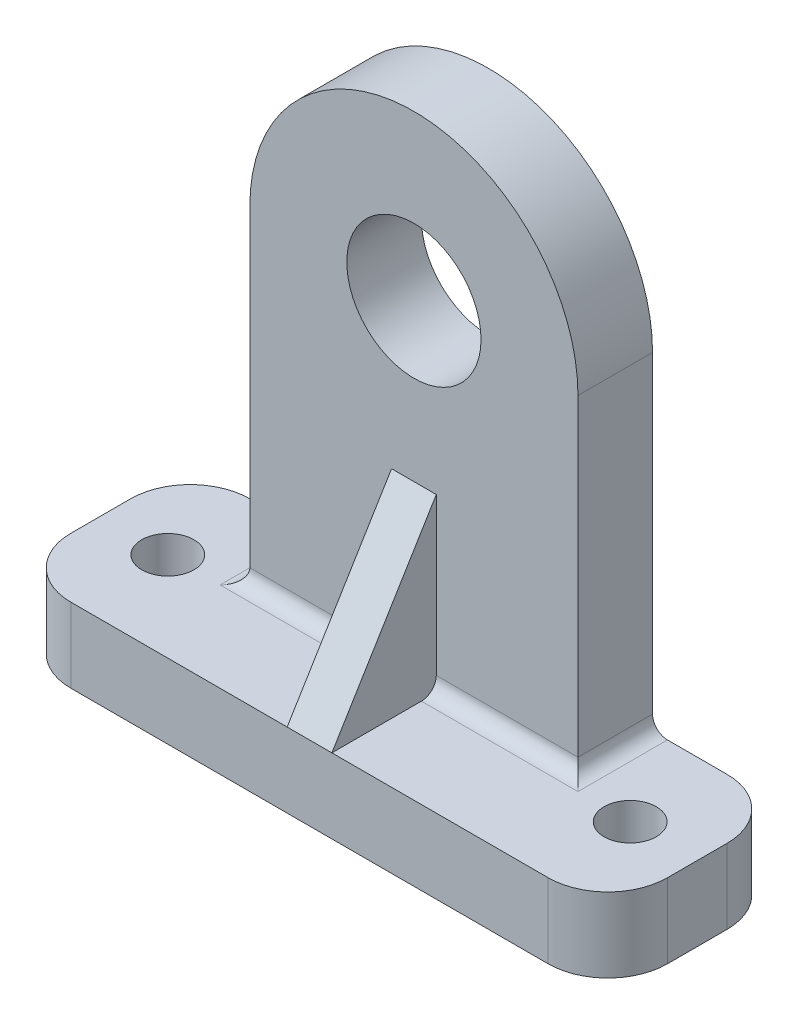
ISO-10303-21;
HEADER;
FILE_DESCRIPTION(('STEP AP214'),'2;1');
FILE_NAME('part.step','',(''),(''),'','','');
FILE_SCHEMA(('AUTOMOTIVE_DESIGN { 1 0 10303 214 1 1 1 1 }'));
ENDSEC;
DATA;
#1=APPLICATION_CONTEXT('core data for automotive mechanical design processes');
#2=APPLICATION_PROTOCOL_DEFINITION('international standard','automotive_design',2000,#1);
#3=PRODUCT_CONTEXT('',#1,'mechanical');
#4=PRODUCT('Part','Part','',(#3));
#5=PRODUCT_RELATED_PRODUCT_CATEGORY('part','',(#4));
#6=PRODUCT_DEFINITION_FORMATION('','',#4);
#7=PRODUCT_DEFINITION_CONTEXT('part definition',#1,'design');
#8=PRODUCT_DEFINITION('design','',#6,#7);
#9=PRODUCT_DEFINITION_SHAPE('','',#8);
#10=(LENGTH_UNIT() NAMED_UNIT(*) SI_UNIT(.MILLI.,.METRE.));
#11=(NAMED_UNIT(*) PLANE_ANGLE_UNIT() SI_UNIT($,.RADIAN.));
#12=(NAMED_UNIT(*) SI_UNIT($,.STERADIAN.) SOLID_ANGLE_UNIT());
#13=UNCERTAINTY_MEASURE_WITH_UNIT(LENGTH_MEASURE(1.E-05),#10,'distance_accuracy_value','');
#14=(GEOMETRIC_REPRESENTATION_CONTEXT(3) GLOBAL_UNCERTAINTY_ASSIGNED_CONTEXT((#13)) GLOBAL_UNIT_ASSIGNED_CONTEXT((#10,
#11,#12)) REPRESENTATION_CONTEXT('',''));
#15=CARTESIAN_POINT('',(0.,0.,0.));
#16=DIRECTION('',(0.,0.,1.));
#17=DIRECTION('',(1.,0.,0.));
#18=AXIS2_PLACEMENT_3D('',#15,#16,#17);
#19=CARTESIAN_POINT('',(0.,-22.,0.));
#20=DIRECTION('',(0.,1.,0.));
#21=DIRECTION('',(0.,0.,1.));
#22=AXIS2_PLACEMENT_3D('',#19,#20,#21);
#23=PLANE('',#22);
#24=CARTESIAN_POINT('',(-15.5,-22.,6.));
#25=DIRECTION('',(0.,-1.,0.));
#26=DIRECTION('',(0.,0.,1.));
#27=AXIS2_PLACEMENT_3D('',#24,#25,#26);
#28=CIRCLE('',#27,1.75);
#29=CARTESIAN_POINT('',(-15.5,-22.,7.75));
#30=VERTEX_POINT('',#29);
#31=EDGE_CURVE('E293',#30,#30,#28,.T.);
#32=ORIENTED_EDGE('',*,*,#31,.T.);
#33=EDGE_LOOP('',(#32));
#34=FACE_BOUND('',#33,.T.);
#35=DIRECTION('',(-1.,0.,0.));
#36=VECTOR('',#35,1.);
#37=CARTESIAN_POINT('',(-20.,-22.,12.));
#38=LINE('',#37,#36);
#39=CARTESIAN_POINT('',(-1.5,-22.,12.));
#40=VERTEX_POINT('',#39);
#41=CARTESIAN_POINT('',(-16.,-22.,12.));
#42=VERTEX_POINT('',#41);
#43=EDGE_CURVE('E176',#40,#42,#38,.T.);
#44=ORIENTED_EDGE('',*,*,#43,.F.);
#45=DIRECTION('',(0.,0.,-1.));
#46=VECTOR('',#45,1.);
#47=CARTESIAN_POINT('',(-1.5,-22.,0.));
#48=LINE('',#47,#46);
#49=CARTESIAN_POINT('',(-1.5,-22.,6.));
#50=VERTEX_POINT('',#49);
#51=EDGE_CURVE('E174',#40,#50,#48,.T.);
#52=ORIENTED_EDGE('',*,*,#51,.T.);
#53=DIRECTION('',(1.,0.,0.));
#54=VECTOR('',#53,1.);
#55=CARTESIAN_POINT('',(-11.,-22.,6.));
#56=LINE('',#55,#54);
#57=CARTESIAN_POINT('',(-12.,-22.,6.));
#58=VERTEX_POINT('',#57);
#59=EDGE_CURVE('E160',#50,#58,#56,.F.);
#60=ORIENTED_EDGE('',*,*,#59,.T.);
#61=DIRECTION('',(0.,0.,-1.));
#62=VECTOR('',#61,1.);
#63=CARTESIAN_POINT('',(-12.,-22.,0.));
#64=LINE('',#63,#62);
#65=CARTESIAN_POINT('',(-12.,-22.,0.));
#66=VERTEX_POINT('',#65);
#67=EDGE_CURVE('E239',#58,#66,#64,.T.);
#68=ORIENTED_EDGE('',*,*,#67,.T.);
#69=DIRECTION('',(1.,0.,0.));
#70=VECTOR('',#69,1.);
#71=CARTESIAN_POINT('',(-20.,-22.,0.));
#72=LINE('',#71,#70);
#73=CARTESIAN_POINT('',(-16.,-22.,0.));
#74=VERTEX_POINT('',#73);
#75=EDGE_CURVE('E265',#74,#66,#72,.T.);
#76=ORIENTED_EDGE('',*,*,#75,.F.);
#77=CARTESIAN_POINT('',(-16.,-22.,4.));
#78=DIRECTION('',(0.,1.,0.));
#79=DIRECTION('',(0.,0.,1.));
#80=AXIS2_PLACEMENT_3D('',#77,#78,#79);
#81=CIRCLE('',#80,4.);
#82=CARTESIAN_POINT('',(-20.,-22.,4.));
#83=VERTEX_POINT('',#82);
#84=EDGE_CURVE('E209',#74,#83,#81,.T.);
#85=ORIENTED_EDGE('',*,*,#84,.T.);
#86=DIRECTION('',(0.,0.,-1.));
#87=VECTOR('',#86,1.);
#88=CARTESIAN_POINT('',(-20.,-22.,0.));
#89=LINE('',#88,#87);
#90=CARTESIAN_POINT('',(-20.,-22.,8.));
#91=VERTEX_POINT('',#90);
#92=EDGE_CURVE('E269',#91,#83,#89,.T.);
#93=ORIENTED_EDGE('',*,*,#92,.F.);
#94=CARTESIAN_POINT('',(-16.,-22.,8.));
#95=DIRECTION('',(0.,1.,0.));
#96=DIRECTION('',(0.,0.,1.));
#97=AXIS2_PLACEMENT_3D('',#94,#95,#96);
#98=CIRCLE('',#97,4.);
#99=EDGE_CURVE('E211',#91,#42,#98,.T.);
#100=ORIENTED_EDGE('',*,*,#99,.T.);
#101=EDGE_LOOP('',(#44,#52,#60,#68,#76,#85,#93,#100));
#102=FACE_BOUND('',#101,.T.);
#103=ADVANCED_FACE('F38',(#34,#102),#23,.T.);
#104=CARTESIAN_POINT('',(0.,-21.,6.));
#105=DIRECTION('',(-1.,0.,0.));
#106=DIRECTION('',(0.,0.,1.));
#107=AXIS2_PLACEMENT_3D('',#104,#105,#106);
#108=CYLINDRICAL_SURFACE('',#107,1.);
#109=CARTESIAN_POINT('',(-1.5,-21.,6.));
#110=DIRECTION('',(1.,0.,0.));
#111=DIRECTION('',(0.,0.,-1.));
#112=AXIS2_PLACEMENT_3D('',#109,#110,#111);
#113=CIRCLE('',#112,1.);
#114=CARTESIAN_POINT('',(-1.5,-21.,5.));
#115=VERTEX_POINT('',#114);
#116=EDGE_CURVE('E46',#115,#50,#113,.F.);
#117=ORIENTED_EDGE('',*,*,#116,.F.);
#118=DIRECTION('',(1.,0.,0.));
#119=VECTOR('',#118,1.);
#120=CARTESIAN_POINT('',(11.,-21.,5.));
#121=LINE('',#120,#119);
#122=CARTESIAN_POINT('',(-11.,-21.,5.));
#123=VERTEX_POINT('',#122);
#124=EDGE_CURVE('E234',#123,#115,#121,.T.);
#125=ORIENTED_EDGE('',*,*,#124,.F.);
#126=CARTESIAN_POINT('',(-12.,-21.,6.));
#127=DIRECTION('',(-0.707106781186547,0.,-0.707106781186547));
#128=DIRECTION('',(-0.707106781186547,0.,0.707106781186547));
#129=AXIS2_PLACEMENT_3D('',#126,#127,#128);
#130=ELLIPSE('',#129,1.41421356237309,1.);
#131=EDGE_CURVE('E166',#58,#123,#130,.F.);
#132=ORIENTED_EDGE('',*,*,#131,.F.);
#133=ORIENTED_EDGE('',*,*,#59,.F.);
#134=EDGE_LOOP('',(#117,#125,#132,#133));
#135=FACE_BOUND('',#134,.T.);
#136=ADVANCED_FACE('F162',(#135),#108,.F.);
#137=CARTESIAN_POINT('',(11.,0.,5.));
#138=DIRECTION('',(1.,0.,0.));
#139=DIRECTION('',(0.,0.,-1.));
#140=AXIS2_PLACEMENT_3D('',#137,#138,#139);
#141=PLANE('',#140);
#142=DIRECTION('',(0.,-1.,0.));
#143=VECTOR('',#142,1.);
#144=CARTESIAN_POINT('',(11.,0.,5.));
#145=LINE('',#144,#143);
#146=CARTESIAN_POINT('',(11.,0.,5.));
#147=VERTEX_POINT('',#146);
#148=CARTESIAN_POINT('',(11.,-21.,5.));
#149=VERTEX_POINT('',#148);
#150=EDGE_CURVE('E251',#147,#149,#145,.T.);
#151=ORIENTED_EDGE('',*,*,#150,.T.);
#152=DIRECTION('',(0.,0.,-1.));
#153=VECTOR('',#152,1.);
#154=CARTESIAN_POINT('',(11.,-21.,0.));
#155=LINE('',#154,#153);
#156=CARTESIAN_POINT('',(11.,-21.,0.));
#157=VERTEX_POINT('',#156);
#158=EDGE_CURVE('E232',#149,#157,#155,.T.);
#159=ORIENTED_EDGE('',*,*,#158,.T.);
#160=DIRECTION('',(0.,-1.,0.));
#161=VECTOR('',#160,1.);
#162=CARTESIAN_POINT('',(11.,0.,0.));
#163=LINE('',#162,#161);
#164=CARTESIAN_POINT('',(11.,0.,0.));
#165=VERTEX_POINT('',#164);
#166=EDGE_CURVE('E255',#165,#157,#163,.T.);
#167=ORIENTED_EDGE('',*,*,#166,.F.);
#168=DIRECTION('',(0.,0.,-1.));
#169=VECTOR('',#168,1.);
#170=CARTESIAN_POINT('',(11.,0.,5.));
#171=LINE('',#170,#169);
#172=EDGE_CURVE('E243',#147,#165,#171,.T.);
#173=ORIENTED_EDGE('',*,*,#172,.F.);
#174=EDGE_LOOP('',(#151,#159,#167,#173));
#175=FACE_BOUND('',#174,.T.);
#176=ADVANCED_FACE('F343',(#175),#141,.T.);
#177=CARTESIAN_POINT('',(0.,0.,5.));
#178=DIRECTION('',(0.,0.,-1.));
#179=DIRECTION('',(-1.,0.,0.));
#180=AXIS2_PLACEMENT_3D('',#177,#178,#179);
#181=CYLINDRICAL_SURFACE('',#180,11.);
#182=CARTESIAN_POINT('',(0.,0.,0.));
#183=DIRECTION('',(0.,0.,1.));
#184=DIRECTION('',(1.,0.,0.));
#185=AXIS2_PLACEMENT_3D('',#182,#183,#184);
#186=CIRCLE('',#185,11.);
#187=CARTESIAN_POINT('',(-11.,0.,0.));
#188=VERTEX_POINT('',#187);
#189=EDGE_CURVE('E249',#165,#188,#186,.T.);
#190=ORIENTED_EDGE('',*,*,#189,.T.);
#191=DIRECTION('',(0.,0.,-1.));
#192=VECTOR('',#191,1.);
#193=CARTESIAN_POINT('',(-11.,0.,5.));
#194=LINE('',#193,#192);
#195=CARTESIAN_POINT('',(-11.,0.,5.));
#196=VERTEX_POINT('',#195);
#197=EDGE_CURVE('E244',#196,#188,#194,.T.);
#198=ORIENTED_EDGE('',*,*,#197,.F.);
#199=CARTESIAN_POINT('',(0.,0.,5.));
#200=DIRECTION('',(0.,0.,1.));
#201=DIRECTION('',(1.,0.,0.));
#202=AXIS2_PLACEMENT_3D('',#199,#200,#201);
#203=CIRCLE('',#202,11.);
#204=EDGE_CURVE('E247',#147,#196,#203,.T.);
#205=ORIENTED_EDGE('',*,*,#204,.F.);
#206=ORIENTED_EDGE('',*,*,#172,.T.);
#207=EDGE_LOOP('',(#190,#198,#205,#206));
#208=FACE_BOUND('',#207,.T.);
#209=ADVANCED_FACE('F396',(#208),#181,.T.);
#210=CARTESIAN_POINT('',(-11.,0.,5.));
#211=DIRECTION('',(1.,0.,0.));
#212=DIRECTION('',(0.,0.,-1.));
#213=AXIS2_PLACEMENT_3D('',#210,#211,#212);
#214=PLANE('',#213);
#215=DIRECTION('',(0.,-1.,0.));
#216=VECTOR('',#215,1.);
#217=CARTESIAN_POINT('',(-11.,0.,0.));
#218=LINE('',#217,#216);
#219=CARTESIAN_POINT('',(-11.,-21.,0.));
#220=VERTEX_POINT('',#219);
#221=EDGE_CURVE('E252',#188,#220,#218,.T.);
#222=ORIENTED_EDGE('',*,*,#221,.T.);
#223=DIRECTION('',(0.,0.,-1.));
#224=VECTOR('',#223,1.);
#225=CARTESIAN_POINT('',(-11.,-21.,5.));
#226=LINE('',#225,#224);
#227=EDGE_CURVE('E237',#220,#123,#226,.F.);
#228=ORIENTED_EDGE('',*,*,#227,.T.);
#229=DIRECTION('',(0.,-1.,0.));
#230=VECTOR('',#229,1.);
#231=CARTESIAN_POINT('',(-11.,0.,5.));
#232=LINE('',#231,#230);
#233=EDGE_CURVE('E260',#196,#123,#232,.T.);
#234=ORIENTED_EDGE('',*,*,#233,.F.);
#235=ORIENTED_EDGE('',*,*,#197,.T.);
#236=EDGE_LOOP('',(#222,#228,#234,#235));
#237=FACE_BOUND('',#236,.T.);
#238=ADVANCED_FACE('F392',(#237),#214,.F.);
#239=CARTESIAN_POINT('',(0.,0.,5.));
#240=DIRECTION('',(0.,0.,1.));
#241=DIRECTION('',(1.,0.,0.));
#242=AXIS2_PLACEMENT_3D('',#239,#240,#241);
#243=PLANE('',#242);
#244=DIRECTION('',(0.,1.,0.));
#245=VECTOR('',#244,1.);
#246=CARTESIAN_POINT('',(1.5,0.,5.));
#247=LINE('',#246,#245);
#248=CARTESIAN_POINT('',(1.5,-21.,5.));
#249=VERTEX_POINT('',#248);
#250=CARTESIAN_POINT('',(1.5,-10.5,5.));
#251=VERTEX_POINT('',#250);
#252=EDGE_CURVE('E307',#249,#251,#247,.T.);
#253=ORIENTED_EDGE('',*,*,#252,.F.);
#254=EDGE_CURVE('E236',#249,#149,#121,.T.);
#255=ORIENTED_EDGE('',*,*,#254,.T.);
#256=ORIENTED_EDGE('',*,*,#150,.F.);
#257=ORIENTED_EDGE('',*,*,#204,.T.);
#258=ORIENTED_EDGE('',*,*,#233,.T.);
#259=ORIENTED_EDGE('',*,*,#124,.T.);
#260=DIRECTION('',(0.,1.,0.));
#261=VECTOR('',#260,1.);
#262=CARTESIAN_POINT('',(-1.5,0.,5.));
#263=LINE('',#262,#261);
#264=CARTESIAN_POINT('',(-1.5,-10.5,5.));
#265=VERTEX_POINT('',#264);
#266=EDGE_CURVE('E58',#115,#265,#263,.T.);
#267=ORIENTED_EDGE('',*,*,#266,.T.);
#268=DIRECTION('',(-1.,0.,0.));
#269=VECTOR('',#268,1.);
#270=CARTESIAN_POINT('',(0.,-10.5,5.));
#271=LINE('',#270,#269);
#272=EDGE_CURVE('E53',#251,#265,#271,.T.);
#273=ORIENTED_EDGE('',*,*,#272,.F.);
#274=EDGE_LOOP('',(#253,#255,#256,#257,#258,#259,#267,#273));
#275=FACE_BOUND('',#274,.T.);
#276=CARTESIAN_POINT('',(0.,0.,5.));
#277=DIRECTION('',(0.,0.,1.));
#278=DIRECTION('',(1.,0.,0.));
#279=AXIS2_PLACEMENT_3D('',#276,#277,#278);
#280=CIRCLE('',#279,4.5);
#281=CARTESIAN_POINT('',(4.5,0.,5.));
#282=VERTEX_POINT('',#281);
#283=EDGE_CURVE('E296',#282,#282,#280,.F.);
#284=ORIENTED_EDGE('',*,*,#283,.T.);
#285=EDGE_LOOP('',(#284));
#286=FACE_BOUND('',#285,.T.);
#287=ADVANCED_FACE('F339',(#275,#286),#243,.T.);
#288=CARTESIAN_POINT('',(0.,0.,0.));
#289=DIRECTION('',(0.,0.,1.));
#290=DIRECTION('',(1.,0.,0.));
#291=AXIS2_PLACEMENT_3D('',#288,#289,#290);
#292=PLANE('',#291);
#293=CARTESIAN_POINT('',(0.,0.,0.));
#294=DIRECTION('',(0.,0.,1.));
#295=DIRECTION('',(1.,0.,0.));
#296=AXIS2_PLACEMENT_3D('',#293,#294,#295);
#297=CIRCLE('',#296,4.5);
#298=CARTESIAN_POINT('',(4.5,0.,0.));
#299=VERTEX_POINT('',#298);
#300=EDGE_CURVE('E227',#299,#299,#297,.T.);
#301=ORIENTED_EDGE('',*,*,#300,.T.);
#302=EDGE_LOOP('',(#301));
#303=FACE_BOUND('',#302,.T.);
#304=DIRECTION('',(0.,1.,0.));
#305=VECTOR('',#304,1.);
#306=CARTESIAN_POINT('',(16.,0.,0.));
#307=LINE('',#306,#305);
#308=CARTESIAN_POINT('',(16.,-22.,0.));
#309=VERTEX_POINT('',#308);
#310=CARTESIAN_POINT('',(16.,-27.,0.));
#311=VERTEX_POINT('',#310);
#312=EDGE_CURVE('E220',#309,#311,#307,.F.);
#313=ORIENTED_EDGE('',*,*,#312,.T.);
#314=DIRECTION('',(1.,0.,0.));
#315=VECTOR('',#314,1.);
#316=CARTESIAN_POINT('',(-20.,-27.,0.));
#317=LINE('',#316,#315);
#318=CARTESIAN_POINT('',(-16.,-27.,0.));
#319=VERTEX_POINT('',#318);
#320=EDGE_CURVE('E258',#319,#311,#317,.T.);
#321=ORIENTED_EDGE('',*,*,#320,.F.);
#322=DIRECTION('',(0.,1.,0.));
#323=VECTOR('',#322,1.);
#324=CARTESIAN_POINT('',(-16.,0.,0.));
#325=LINE('',#324,#323);
#326=EDGE_CURVE('E217',#319,#74,#325,.T.);
#327=ORIENTED_EDGE('',*,*,#326,.T.);
#328=ORIENTED_EDGE('',*,*,#75,.T.);
#329=CARTESIAN_POINT('',(-12.,-21.,0.));
#330=DIRECTION('',(0.,0.,1.));
#331=DIRECTION('',(1.,0.,0.));
#332=AXIS2_PLACEMENT_3D('',#329,#330,#331);
#333=CIRCLE('',#332,1.);
#334=EDGE_CURVE('E230',#66,#220,#333,.T.);
#335=ORIENTED_EDGE('',*,*,#334,.T.);
#336=ORIENTED_EDGE('',*,*,#221,.F.);
#337=ORIENTED_EDGE('',*,*,#189,.F.);
#338=ORIENTED_EDGE('',*,*,#166,.T.);
#339=CARTESIAN_POINT('',(12.,-21.,0.));
#340=DIRECTION('',(0.,0.,1.));
#341=DIRECTION('',(1.,0.,0.));
#342=AXIS2_PLACEMENT_3D('',#339,#340,#341);
#343=CIRCLE('',#342,1.);
#344=CARTESIAN_POINT('',(12.,-22.,0.));
#345=VERTEX_POINT('',#344);
#346=EDGE_CURVE('E223',#157,#345,#343,.T.);
#347=ORIENTED_EDGE('',*,*,#346,.T.);
#348=EDGE_CURVE('E268',#345,#309,#72,.T.);
#349=ORIENTED_EDGE('',*,*,#348,.T.);
#350=EDGE_LOOP('',(#313,#321,#327,#328,#335,#336,#337,#338,#347,#349));
#351=FACE_BOUND('',#350,.T.);
#352=ADVANCED_FACE('F351',(#303,#351),#292,.F.);
#353=DIRECTION('',(0.,0.,-1.));
#354=VECTOR('',#353,1.);
#355=CARTESIAN_POINT('',(1.5,-22.,0.));
#356=LINE('',#355,#354);
#357=CARTESIAN_POINT('',(1.5,-22.,12.));
#358=VERTEX_POINT('',#357);
#359=CARTESIAN_POINT('',(1.5,-22.,6.));
#360=VERTEX_POINT('',#359);
#361=EDGE_CURVE('E309',#358,#360,#356,.T.);
#362=ORIENTED_EDGE('',*,*,#361,.F.);
#363=CARTESIAN_POINT('',(16.,-22.,12.));
#364=VERTEX_POINT('',#363);
#365=EDGE_CURVE('E272',#364,#358,#38,.T.);
#366=ORIENTED_EDGE('',*,*,#365,.F.);
#367=CARTESIAN_POINT('',(16.,-22.,8.00000000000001));
#368=DIRECTION('',(0.,1.,0.));
#369=DIRECTION('',(0.,0.,1.));
#370=AXIS2_PLACEMENT_3D('',#367,#368,#369);
#371=CIRCLE('',#370,4.);
#372=CARTESIAN_POINT('',(20.,-22.,8.00000000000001));
#373=VERTEX_POINT('',#372);
#374=EDGE_CURVE('E215',#364,#373,#371,.T.);
#375=ORIENTED_EDGE('',*,*,#374,.T.);
#376=DIRECTION('',(0.,0.,1.));
#377=VECTOR('',#376,1.);
#378=CARTESIAN_POINT('',(20.,-22.,0.));
#379=LINE('',#378,#377);
#380=CARTESIAN_POINT('',(20.,-22.,4.));
#381=VERTEX_POINT('',#380);
#382=EDGE_CURVE('E275',#381,#373,#379,.T.);
#383=ORIENTED_EDGE('',*,*,#382,.F.);
#384=CARTESIAN_POINT('',(16.,-22.,4.));
#385=DIRECTION('',(0.,1.,0.));
#386=DIRECTION('',(0.,0.,1.));
#387=AXIS2_PLACEMENT_3D('',#384,#385,#386);
#388=CIRCLE('',#387,4.);
#389=EDGE_CURVE('E213',#381,#309,#388,.T.);
#390=ORIENTED_EDGE('',*,*,#389,.T.);
#391=ORIENTED_EDGE('',*,*,#348,.F.);
#392=DIRECTION('',(0.,0.,-1.));
#393=VECTOR('',#392,1.);
#394=CARTESIAN_POINT('',(12.,-22.,5.));
#395=LINE('',#394,#393);
#396=CARTESIAN_POINT('',(12.,-22.,6.));
#397=VERTEX_POINT('',#396);
#398=EDGE_CURVE('E171',#345,#397,#395,.F.);
#399=ORIENTED_EDGE('',*,*,#398,.T.);
#400=EDGE_CURVE('E170',#397,#360,#56,.F.);
#401=ORIENTED_EDGE('',*,*,#400,.T.);
#402=EDGE_LOOP('',(#362,#366,#375,#383,#390,#391,#399,#401));
#403=FACE_BOUND('',#402,.T.);
#404=CARTESIAN_POINT('',(15.5,-22.,6.));
#405=DIRECTION('',(0.,-1.,0.));
#406=DIRECTION('',(0.,0.,-1.));
#407=AXIS2_PLACEMENT_3D('',#404,#405,#406);
#408=CIRCLE('',#407,1.75);
#409=CARTESIAN_POINT('',(15.5,-22.,4.25000000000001));
#410=VERTEX_POINT('',#409);
#411=EDGE_CURVE('E287',#410,#410,#408,.T.);
#412=ORIENTED_EDGE('',*,*,#411,.T.);
#413=EDGE_LOOP('',(#412));
#414=FACE_BOUND('',#413,.T.);
#415=ADVANCED_FACE('F328',(#403,#414),#23,.T.);
#416=CARTESIAN_POINT('',(0.,-27.,0.));
#417=DIRECTION('',(0.,1.,0.));
#418=DIRECTION('',(0.,0.,1.));
#419=AXIS2_PLACEMENT_3D('',#416,#417,#418);
#420=PLANE('',#419);
#421=DIRECTION('',(-1.,0.,0.));
#422=VECTOR('',#421,1.);
#423=CARTESIAN_POINT('',(-20.,-27.,12.));
#424=LINE('',#423,#422);
#425=CARTESIAN_POINT('',(16.,-27.,12.));
#426=VERTEX_POINT('',#425);
#427=CARTESIAN_POINT('',(-16.,-27.,12.));
#428=VERTEX_POINT('',#427);
#429=EDGE_CURVE('E283',#426,#428,#424,.T.);
#430=ORIENTED_EDGE('',*,*,#429,.T.);
#431=CARTESIAN_POINT('',(-16.,-27.,8.));
#432=DIRECTION('',(0.,1.,0.));
#433=DIRECTION('',(0.,0.,1.));
#434=AXIS2_PLACEMENT_3D('',#431,#432,#433);
#435=CIRCLE('',#434,4.);
#436=CARTESIAN_POINT('',(-20.,-27.,8.));
#437=VERTEX_POINT('',#436);
#438=EDGE_CURVE('E198',#428,#437,#435,.F.);
#439=ORIENTED_EDGE('',*,*,#438,.T.);
#440=DIRECTION('',(0.,0.,-1.));
#441=VECTOR('',#440,1.);
#442=CARTESIAN_POINT('',(-20.,-27.,0.));
#443=LINE('',#442,#441);
#444=CARTESIAN_POINT('',(-20.,-27.,4.));
#445=VERTEX_POINT('',#444);
#446=EDGE_CURVE('E280',#437,#445,#443,.T.);
#447=ORIENTED_EDGE('',*,*,#446,.T.);
#448=CARTESIAN_POINT('',(-16.,-27.,4.));
#449=DIRECTION('',(0.,1.,0.));
#450=DIRECTION('',(0.,0.,1.));
#451=AXIS2_PLACEMENT_3D('',#448,#449,#450);
#452=CIRCLE('',#451,4.);
#453=EDGE_CURVE('E196',#445,#319,#452,.F.);
#454=ORIENTED_EDGE('',*,*,#453,.T.);
#455=ORIENTED_EDGE('',*,*,#320,.T.);
#456=CARTESIAN_POINT('',(16.,-27.,4.));
#457=DIRECTION('',(0.,1.,0.));
#458=DIRECTION('',(0.,0.,1.));
#459=AXIS2_PLACEMENT_3D('',#456,#457,#458);
#460=CIRCLE('',#459,4.);
#461=CARTESIAN_POINT('',(20.,-27.,4.));
#462=VERTEX_POINT('',#461);
#463=EDGE_CURVE('E200',#311,#462,#460,.F.);
#464=ORIENTED_EDGE('',*,*,#463,.T.);
#465=DIRECTION('',(0.,0.,1.));
#466=VECTOR('',#465,1.);
#467=CARTESIAN_POINT('',(20.,-27.,0.));
#468=LINE('',#467,#466);
#469=CARTESIAN_POINT('',(20.,-27.,8.00000000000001));
#470=VERTEX_POINT('',#469);
#471=EDGE_CURVE('E267',#462,#470,#468,.T.);
#472=ORIENTED_EDGE('',*,*,#471,.T.);
#473=CARTESIAN_POINT('',(16.,-27.,8.00000000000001));
#474=DIRECTION('',(0.,1.,0.));
#475=DIRECTION('',(0.,0.,1.));
#476=AXIS2_PLACEMENT_3D('',#473,#474,#475);
#477=CIRCLE('',#476,4.);
#478=EDGE_CURVE('E202',#470,#426,#477,.F.);
#479=ORIENTED_EDGE('',*,*,#478,.T.);
#480=EDGE_LOOP('',(#430,#439,#447,#454,#455,#464,#472,#479));
#481=FACE_BOUND('',#480,.T.);
#482=CARTESIAN_POINT('',(15.5,-27.,6.));
#483=DIRECTION('',(0.,-1.,0.));
#484=DIRECTION('',(0.,0.,-1.));
#485=AXIS2_PLACEMENT_3D('',#482,#483,#484);
#486=CIRCLE('',#485,1.75);
#487=CARTESIAN_POINT('',(15.5,-27.,4.25000000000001));
#488=VERTEX_POINT('',#487);
#489=EDGE_CURVE('E278',#488,#488,#486,.T.);
#490=ORIENTED_EDGE('',*,*,#489,.F.);
#491=EDGE_LOOP('',(#490));
#492=FACE_BOUND('',#491,.T.);
#493=CARTESIAN_POINT('',(-15.5,-27.,6.));
#494=DIRECTION('',(0.,-1.,0.));
#495=DIRECTION('',(0.,0.,1.));
#496=AXIS2_PLACEMENT_3D('',#493,#494,#495);
#497=CIRCLE('',#496,1.75);
#498=CARTESIAN_POINT('',(-15.5,-27.,7.75));
#499=VERTEX_POINT('',#498);
#500=EDGE_CURVE('E290',#499,#499,#497,.T.);
#501=ORIENTED_EDGE('',*,*,#500,.F.);
#502=EDGE_LOOP('',(#501));
#503=FACE_BOUND('',#502,.T.);
#504=ADVANCED_FACE('F364',(#481,#492,#503),#420,.F.);
#505=CARTESIAN_POINT('',(20.,-27.,0.));
#506=DIRECTION('',(-1.,0.,0.));
#507=DIRECTION('',(0.,0.,1.));
#508=AXIS2_PLACEMENT_3D('',#505,#506,#507);
#509=PLANE('',#508);
#510=ORIENTED_EDGE('',*,*,#471,.F.);
#511=DIRECTION('',(0.,1.,0.));
#512=VECTOR('',#511,1.);
#513=CARTESIAN_POINT('',(20.,-27.,4.));
#514=LINE('',#513,#512);
#515=EDGE_CURVE('E184',#462,#381,#514,.T.);
#516=ORIENTED_EDGE('',*,*,#515,.T.);
#517=ORIENTED_EDGE('',*,*,#382,.T.);
#518=DIRECTION('',(0.,1.,0.));
#519=VECTOR('',#518,1.);
#520=CARTESIAN_POINT('',(20.,-27.,8.00000000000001));
#521=LINE('',#520,#519);
#522=EDGE_CURVE('E186',#373,#470,#521,.F.);
#523=ORIENTED_EDGE('',*,*,#522,.T.);
#524=EDGE_LOOP('',(#510,#516,#517,#523));
#525=FACE_BOUND('',#524,.T.);
#526=ADVANCED_FACE('F360',(#525),#509,.F.);
#527=CARTESIAN_POINT('',(-20.,-27.,12.));
#528=DIRECTION('',(0.,0.,-1.));
#529=DIRECTION('',(-1.,0.,0.));
#530=AXIS2_PLACEMENT_3D('',#527,#528,#529);
#531=PLANE('',#530);
#532=ORIENTED_EDGE('',*,*,#365,.T.);
#533=DIRECTION('',(1.,0.,0.));
#534=VECTOR('',#533,1.);
#535=CARTESIAN_POINT('',(-20.,-22.,12.));
#536=LINE('',#535,#534);
#537=EDGE_CURVE('E304',#40,#358,#536,.T.);
#538=ORIENTED_EDGE('',*,*,#537,.F.);
#539=ORIENTED_EDGE('',*,*,#43,.T.);
#540=DIRECTION('',(0.,1.,0.));
#541=VECTOR('',#540,1.);
#542=CARTESIAN_POINT('',(-16.,-27.,12.));
#543=LINE('',#542,#541);
#544=EDGE_CURVE('E190',#42,#428,#543,.F.);
#545=ORIENTED_EDGE('',*,*,#544,.T.);
#546=ORIENTED_EDGE('',*,*,#429,.F.);
#547=DIRECTION('',(0.,1.,0.));
#548=VECTOR('',#547,1.);
#549=CARTESIAN_POINT('',(16.,-27.,12.));
#550=LINE('',#549,#548);
#551=EDGE_CURVE('E193',#426,#364,#550,.T.);
#552=ORIENTED_EDGE('',*,*,#551,.T.);
#553=EDGE_LOOP('',(#532,#538,#539,#545,#546,#552));
#554=FACE_BOUND('',#553,.T.);
#555=ADVANCED_FACE('F323',(#554),#531,.F.);
#556=CARTESIAN_POINT('',(-20.,-27.,0.));
#557=DIRECTION('',(1.,0.,0.));
#558=DIRECTION('',(0.,0.,-1.));
#559=AXIS2_PLACEMENT_3D('',#556,#557,#558);
#560=PLANE('',#559);
#561=ORIENTED_EDGE('',*,*,#92,.T.);
#562=DIRECTION('',(0.,1.,0.));
#563=VECTOR('',#562,1.);
#564=CARTESIAN_POINT('',(-20.,-27.,4.));
#565=LINE('',#564,#563);
#566=EDGE_CURVE('E204',#83,#445,#565,.F.);
#567=ORIENTED_EDGE('',*,*,#566,.T.);
#568=ORIENTED_EDGE('',*,*,#446,.F.);
#569=DIRECTION('',(0.,1.,0.));
#570=VECTOR('',#569,1.);
#571=CARTESIAN_POINT('',(-20.,-27.,8.));
#572=LINE('',#571,#570);
#573=EDGE_CURVE('E206',#437,#91,#572,.T.);
#574=ORIENTED_EDGE('',*,*,#573,.T.);
#575=EDGE_LOOP('',(#561,#567,#568,#574));
#576=FACE_BOUND('',#575,.T.);
#577=ADVANCED_FACE('F427',(#576),#560,.F.);
#578=CARTESIAN_POINT('',(15.5,-27.,6.));
#579=DIRECTION('',(0.,1.,0.));
#580=DIRECTION('',(0.,0.,1.));
#581=AXIS2_PLACEMENT_3D('',#578,#579,#580);
#582=CYLINDRICAL_SURFACE('',#581,1.75);
#583=ORIENTED_EDGE('',*,*,#489,.T.);
#584=EDGE_LOOP('',(#583));
#585=FACE_BOUND('',#584,.T.);
#586=ORIENTED_EDGE('',*,*,#411,.F.);
#587=EDGE_LOOP('',(#586));
#588=FACE_BOUND('',#587,.T.);
#589=ADVANCED_FACE('F439',(#585,#588),#582,.F.);
#590=CARTESIAN_POINT('',(-15.5,-27.,6.));
#591=DIRECTION('',(0.,1.,0.));
#592=DIRECTION('',(0.,0.,1.));
#593=AXIS2_PLACEMENT_3D('',#590,#591,#592);
#594=CYLINDRICAL_SURFACE('',#593,1.75);
#595=ORIENTED_EDGE('',*,*,#500,.T.);
#596=EDGE_LOOP('',(#595));
#597=FACE_BOUND('',#596,.T.);
#598=ORIENTED_EDGE('',*,*,#31,.F.);
#599=EDGE_LOOP('',(#598));
#600=FACE_BOUND('',#599,.T.);
#601=ADVANCED_FACE('F444',(#597,#600),#594,.F.);
#602=CARTESIAN_POINT('',(0.,0.,8.));
#603=DIRECTION('',(0.,0.,-1.));
#604=DIRECTION('',(-1.,0.,0.));
#605=AXIS2_PLACEMENT_3D('',#602,#603,#604);
#606=CYLINDRICAL_SURFACE('',#605,4.5);
#607=ORIENTED_EDGE('',*,*,#300,.F.);
#608=EDGE_LOOP('',(#607));
#609=FACE_BOUND('',#608,.T.);
#610=ORIENTED_EDGE('',*,*,#283,.F.);
#611=EDGE_LOOP('',(#610));
#612=FACE_BOUND('',#611,.T.);
#613=ADVANCED_FACE('F413',(#609,#612),#606,.F.);
#614=CARTESIAN_POINT('',(12.,-21.,5.));
#615=DIRECTION('',(0.,0.,1.));
#616=DIRECTION('',(1.,0.,0.));
#617=AXIS2_PLACEMENT_3D('',#614,#615,#616);
#618=CYLINDRICAL_SURFACE('',#617,1.);
#619=ORIENTED_EDGE('',*,*,#346,.F.);
#620=ORIENTED_EDGE('',*,*,#158,.F.);
#621=CARTESIAN_POINT('',(12.,-21.,6.));
#622=DIRECTION('',(-0.707106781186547,0.,0.707106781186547));
#623=DIRECTION('',(0.707106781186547,0.,0.707106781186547));
#624=AXIS2_PLACEMENT_3D('',#621,#622,#623);
#625=ELLIPSE('',#624,1.41421356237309,1.);
#626=EDGE_CURVE('E224',#397,#149,#625,.F.);
#627=ORIENTED_EDGE('',*,*,#626,.F.);
#628=ORIENTED_EDGE('',*,*,#398,.F.);
#629=EDGE_LOOP('',(#619,#620,#627,#628));
#630=FACE_BOUND('',#629,.T.);
#631=ADVANCED_FACE('F348',(#630),#618,.F.);
#632=ORIENTED_EDGE('',*,*,#254,.F.);
#633=CARTESIAN_POINT('',(1.5,-21.,6.));
#634=DIRECTION('',(1.,0.,0.));
#635=DIRECTION('',(0.,0.,-1.));
#636=AXIS2_PLACEMENT_3D('',#633,#634,#635);
#637=CIRCLE('',#636,1.);
#638=EDGE_CURVE('E11',#249,#360,#637,.F.);
#639=ORIENTED_EDGE('',*,*,#638,.T.);
#640=ORIENTED_EDGE('',*,*,#400,.F.);
#641=ORIENTED_EDGE('',*,*,#626,.T.);
#642=EDGE_LOOP('',(#632,#639,#640,#641));
#643=FACE_BOUND('',#642,.T.);
#644=ADVANCED_FACE('F337',(#643),#108,.F.);
#645=CARTESIAN_POINT('',(-12.,-21.,0.));
#646=DIRECTION('',(0.,0.,-1.));
#647=DIRECTION('',(-1.,0.,0.));
#648=AXIS2_PLACEMENT_3D('',#645,#646,#647);
#649=CYLINDRICAL_SURFACE('',#648,1.);
#650=ORIENTED_EDGE('',*,*,#131,.T.);
#651=ORIENTED_EDGE('',*,*,#227,.F.);
#652=ORIENTED_EDGE('',*,*,#334,.F.);
#653=ORIENTED_EDGE('',*,*,#67,.F.);
#654=EDGE_LOOP('',(#650,#651,#652,#653));
#655=FACE_BOUND('',#654,.T.);
#656=ADVANCED_FACE('F405',(#655),#649,.F.);
#657=CARTESIAN_POINT('',(-16.,0.,4.));
#658=DIRECTION('',(0.,1.,0.));
#659=DIRECTION('',(0.,0.,1.));
#660=AXIS2_PLACEMENT_3D('',#657,#658,#659);
#661=CYLINDRICAL_SURFACE('',#660,4.);
#662=ORIENTED_EDGE('',*,*,#453,.F.);
#663=ORIENTED_EDGE('',*,*,#566,.F.);
#664=ORIENTED_EDGE('',*,*,#84,.F.);
#665=ORIENTED_EDGE('',*,*,#326,.F.);
#666=EDGE_LOOP('',(#662,#663,#664,#665));
#667=FACE_BOUND('',#666,.T.);
#668=ADVANCED_FACE('F407',(#667),#661,.T.);
#669=CARTESIAN_POINT('',(-16.,-27.,8.));
#670=DIRECTION('',(0.,1.,0.));
#671=DIRECTION('',(0.,0.,1.));
#672=AXIS2_PLACEMENT_3D('',#669,#670,#671);
#673=CYLINDRICAL_SURFACE('',#672,4.);
#674=ORIENTED_EDGE('',*,*,#438,.F.);
#675=ORIENTED_EDGE('',*,*,#544,.F.);
#676=ORIENTED_EDGE('',*,*,#99,.F.);
#677=ORIENTED_EDGE('',*,*,#573,.F.);
#678=EDGE_LOOP('',(#674,#675,#676,#677));
#679=FACE_BOUND('',#678,.T.);
#680=ADVANCED_FACE('F373',(#679),#673,.T.);
#681=CARTESIAN_POINT('',(16.,-27.,4.));
#682=DIRECTION('',(0.,1.,0.));
#683=DIRECTION('',(0.,0.,1.));
#684=AXIS2_PLACEMENT_3D('',#681,#682,#683);
#685=CYLINDRICAL_SURFACE('',#684,4.);
#686=ORIENTED_EDGE('',*,*,#463,.F.);
#687=ORIENTED_EDGE('',*,*,#312,.F.);
#688=ORIENTED_EDGE('',*,*,#389,.F.);
#689=ORIENTED_EDGE('',*,*,#515,.F.);
#690=EDGE_LOOP('',(#686,#687,#688,#689));
#691=FACE_BOUND('',#690,.T.);
#692=ADVANCED_FACE('F357',(#691),#685,.T.);
#693=CARTESIAN_POINT('',(16.,-27.,8.00000000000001));
#694=DIRECTION('',(0.,1.,0.));
#695=DIRECTION('',(0.,0.,1.));
#696=AXIS2_PLACEMENT_3D('',#693,#694,#695);
#697=CYLINDRICAL_SURFACE('',#696,4.);
#698=ORIENTED_EDGE('',*,*,#478,.F.);
#699=ORIENTED_EDGE('',*,*,#522,.F.);
#700=ORIENTED_EDGE('',*,*,#374,.F.);
#701=ORIENTED_EDGE('',*,*,#551,.F.);
#702=EDGE_LOOP('',(#698,#699,#700,#701));
#703=FACE_BOUND('',#702,.T.);
#704=ADVANCED_FACE('F40',(#703),#697,.T.);
#705=CARTESIAN_POINT('',(0.,-10.5,5.));
#706=DIRECTION('',(0.,0.519946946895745,0.854198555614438));
#707=DIRECTION('',(0.,-0.854198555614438,0.519946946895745));
#708=AXIS2_PLACEMENT_3D('',#705,#706,#707);
#709=PLANE('',#708);
#710=DIRECTION('',(0.,-0.854198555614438,0.519946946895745));
#711=VECTOR('',#710,1.);
#712=CARTESIAN_POINT('',(1.5,-10.5,5.));
#713=LINE('',#712,#711);
#714=EDGE_CURVE('E181',#251,#358,#713,.T.);
#715=ORIENTED_EDGE('',*,*,#714,.F.);
#716=ORIENTED_EDGE('',*,*,#272,.T.);
#717=DIRECTION('',(0.,-0.854198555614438,0.519946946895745));
#718=VECTOR('',#717,1.);
#719=CARTESIAN_POINT('',(-1.5,-10.5,5.));
#720=LINE('',#719,#718);
#721=EDGE_CURVE('E313',#265,#40,#720,.T.);
#722=ORIENTED_EDGE('',*,*,#721,.T.);
#723=ORIENTED_EDGE('',*,*,#537,.T.);
#724=EDGE_LOOP('',(#715,#716,#722,#723));
#725=FACE_BOUND('',#724,.T.);
#726=ADVANCED_FACE('F321',(#725),#709,.T.);
#727=CARTESIAN_POINT('',(1.5,-8.,6.));
#728=DIRECTION('',(1.,0.,0.));
#729=DIRECTION('',(0.,0.,-1.));
#730=AXIS2_PLACEMENT_3D('',#727,#728,#729);
#731=PLANE('',#730);
#732=ORIENTED_EDGE('',*,*,#638,.F.);
#733=ORIENTED_EDGE('',*,*,#252,.T.);
#734=ORIENTED_EDGE('',*,*,#714,.T.);
#735=ORIENTED_EDGE('',*,*,#361,.T.);
#736=EDGE_LOOP('',(#732,#733,#734,#735));
#737=FACE_BOUND('',#736,.T.);
#738=ADVANCED_FACE('F319',(#737),#731,.T.);
#739=CARTESIAN_POINT('',(-1.5,-8.,6.));
#740=DIRECTION('',(1.,0.,0.));
#741=DIRECTION('',(0.,0.,-1.));
#742=AXIS2_PLACEMENT_3D('',#739,#740,#741);
#743=PLANE('',#742);
#744=ORIENTED_EDGE('',*,*,#266,.F.);
#745=ORIENTED_EDGE('',*,*,#116,.T.);
#746=ORIENTED_EDGE('',*,*,#51,.F.);
#747=ORIENTED_EDGE('',*,*,#721,.F.);
#748=EDGE_LOOP('',(#744,#745,#746,#747));
#749=FACE_BOUND('',#748,.T.);
#750=ADVANCED_FACE('F183',(#749),#743,.F.);
#751=CLOSED_SHELL('',(#103,#136,#176,#209,#238,#287,#352,#415,#504,#526,#555,#577,#589,#601,
#613,#631,#644,#656,#668,#680,#692,#704,#726,#738,#750));
#752=MANIFOLD_SOLID_BREP('B2',#751);
#753=ADVANCED_BREP_SHAPE_REPRESENTATION('',(#18,#752),#14);
#754=SHAPE_DEFINITION_REPRESENTATION(#9,#753);
ENDSEC;
END-ISO-10303-21;
